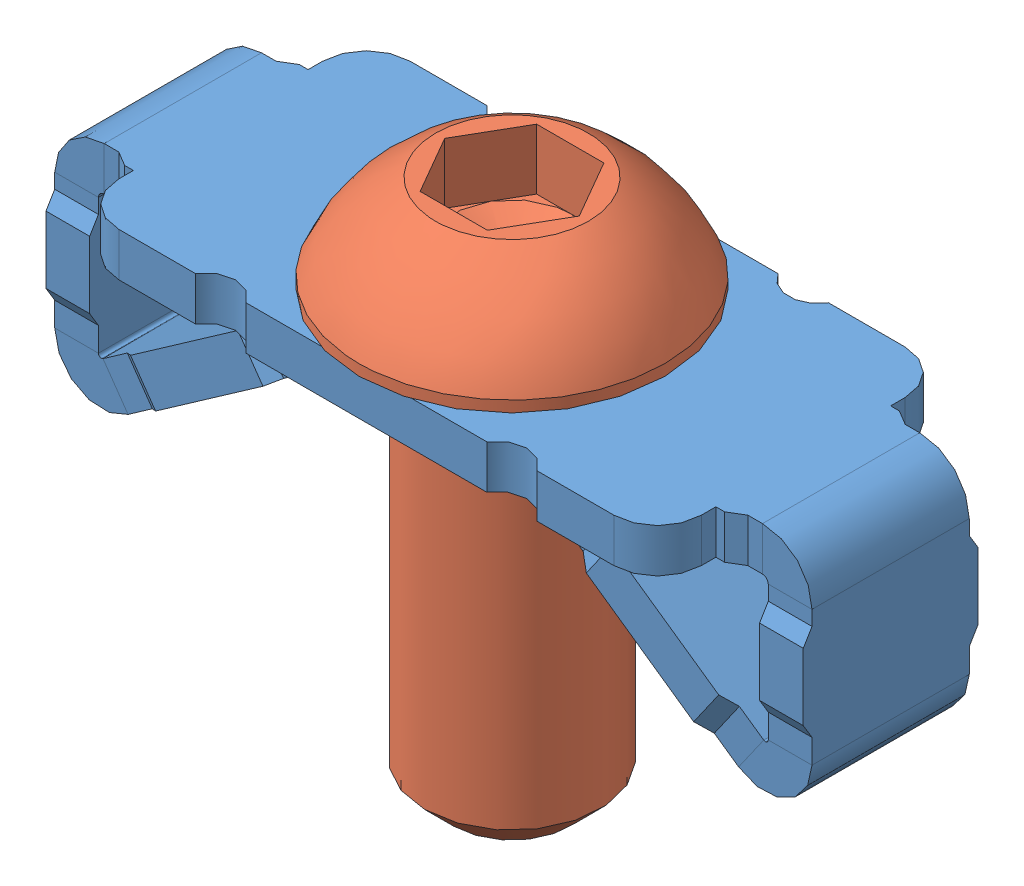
SolidWorks assembly J3SU.SLDASM, configuration Default (file format 7000). Lengths in mm.
Overall size (26 18.3 10.5).
2 component instances, 2 part files, 2 mates.
Components (placement in the parent):
- J3SUH-1: J3SUH.SLDPRT [ﾃﾞﾌｫﾙﾄ] at origin size (26 7.93 10)
- SB0615-1: SB0615.SLDPRT [Default] at (10 4.8 -5) x (0 -1 0) z (0 0 1) size (18.3 10.5 10.5)
Mates (geometry in assembly coordinates):
- 同心円11: concentric: cylinder of J3SUH-1 through (10 1.5 -5) axis (0 -1 0) radius 3.3; cylinder of SB0615-1 through (2.8313 -0.7358 -7.87) axis (-1 0 0) radius 5.25
- 一致11: coincident: plane of J3SUH-1 through (15 1.5 -10.5) normal (0 1 0); plane of SB0615-1 through (6.1313 2.2642 -7.87) normal (1 0 0)
